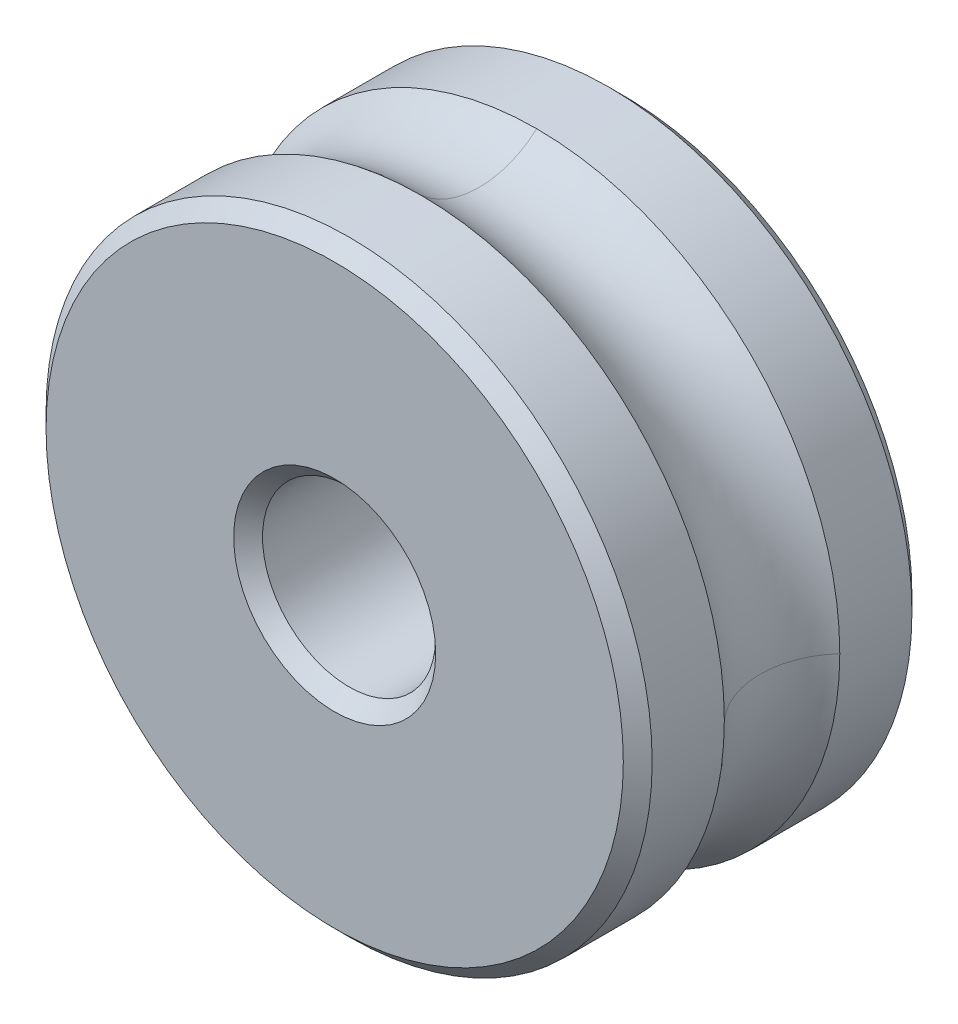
ISO-10303-21;
HEADER;
FILE_DESCRIPTION(('STEP AP214'),'2;1');
FILE_NAME('part.step','',(''),(''),'','','');
FILE_SCHEMA(('AUTOMOTIVE_DESIGN { 1 0 10303 214 1 1 1 1 }'));
ENDSEC;
DATA;
#1=APPLICATION_CONTEXT('core data for automotive mechanical design processes');
#2=APPLICATION_PROTOCOL_DEFINITION('international standard','automotive_design',2000,#1);
#3=PRODUCT_CONTEXT('',#1,'mechanical');
#4=PRODUCT('Part','Part','',(#3));
#5=PRODUCT_RELATED_PRODUCT_CATEGORY('part','',(#4));
#6=PRODUCT_DEFINITION_FORMATION('','',#4);
#7=PRODUCT_DEFINITION_CONTEXT('part definition',#1,'design');
#8=PRODUCT_DEFINITION('design','',#6,#7);
#9=PRODUCT_DEFINITION_SHAPE('','',#8);
#10=(LENGTH_UNIT() NAMED_UNIT(*) SI_UNIT(.MILLI.,.METRE.));
#11=(NAMED_UNIT(*) PLANE_ANGLE_UNIT() SI_UNIT($,.RADIAN.));
#12=(NAMED_UNIT(*) SI_UNIT($,.STERADIAN.) SOLID_ANGLE_UNIT());
#13=UNCERTAINTY_MEASURE_WITH_UNIT(LENGTH_MEASURE(1.E-05),#10,'distance_accuracy_value','');
#14=(GEOMETRIC_REPRESENTATION_CONTEXT(3) GLOBAL_UNCERTAINTY_ASSIGNED_CONTEXT((#13)) GLOBAL_UNIT_ASSIGNED_CONTEXT((#10,
#11,#12)) REPRESENTATION_CONTEXT('',''));
#15=CARTESIAN_POINT('',(0.,0.,0.));
#16=DIRECTION('',(0.,0.,1.));
#17=DIRECTION('',(1.,0.,0.));
#18=AXIS2_PLACEMENT_3D('',#15,#16,#17);
#19=CARTESIAN_POINT('',(0.,0.,10.));
#20=DIRECTION('',(0.,0.,-1.));
#21=DIRECTION('',(-1.,0.,0.));
#22=AXIS2_PLACEMENT_3D('',#19,#20,#21);
#23=CYLINDRICAL_SURFACE('',#22,21.);
#24=CARTESIAN_POINT('',(0.,0.,-4.));
#25=DIRECTION('',(0.,0.,1.));
#26=DIRECTION('',(1.,0.,0.));
#27=AXIS2_PLACEMENT_3D('',#24,#25,#26);
#28=CIRCLE('',#27,21.);
#29=CARTESIAN_POINT('',(0.,21.,-4.));
#30=VERTEX_POINT('',#29);
#31=CARTESIAN_POINT('',(21.,0.,-4.));
#32=VERTEX_POINT('',#31);
#33=EDGE_CURVE('E55',#30,#32,#28,.F.);
#34=ORIENTED_EDGE('',*,*,#33,.T.);
#35=CARTESIAN_POINT('',(0.,0.,-4.));
#36=DIRECTION('',(0.,0.,1.));
#37=DIRECTION('',(1.,0.,0.));
#38=AXIS2_PLACEMENT_3D('',#35,#36,#37);
#39=CIRCLE('',#38,21.);
#40=EDGE_CURVE('E11',#32,#30,#39,.F.);
#41=ORIENTED_EDGE('',*,*,#40,.T.);
#42=EDGE_LOOP('',(#34,#41));
#43=FACE_BOUND('',#42,.T.);
#44=CARTESIAN_POINT('',(0.,0.,-9.));
#45=DIRECTION('',(0.,0.,1.));
#46=DIRECTION('',(1.,0.,0.));
#47=AXIS2_PLACEMENT_3D('',#44,#45,#46);
#48=CIRCLE('',#47,21.);
#49=CARTESIAN_POINT('',(21.,0.,-9.));
#50=VERTEX_POINT('',#49);
#51=EDGE_CURVE('E79',#50,#50,#48,.T.);
#52=ORIENTED_EDGE('',*,*,#51,.T.);
#53=EDGE_LOOP('',(#52));
#54=FACE_BOUND('',#53,.T.);
#55=ADVANCED_FACE('F45',(#43,#54),#23,.T.);
#56=CARTESIAN_POINT('',(0.,0.,10.));
#57=DIRECTION('',(0.,0.,-1.));
#58=DIRECTION('',(-1.,0.,0.));
#59=AXIS2_PLACEMENT_3D('',#56,#57,#58);
#60=CYLINDRICAL_SURFACE('',#59,6.);
#61=CARTESIAN_POINT('',(0.,0.,-8.99999999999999));
#62=DIRECTION('',(0.,0.,1.));
#63=DIRECTION('',(1.,0.,0.));
#64=AXIS2_PLACEMENT_3D('',#61,#62,#63);
#65=CIRCLE('',#64,6.);
#66=CARTESIAN_POINT('',(6.,0.,-8.99999999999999));
#67=VERTEX_POINT('',#66);
#68=EDGE_CURVE('E108',#67,#67,#65,.F.);
#69=ORIENTED_EDGE('',*,*,#68,.T.);
#70=EDGE_LOOP('',(#69));
#71=FACE_BOUND('',#70,.T.);
#72=CARTESIAN_POINT('',(0.,0.,8.99999999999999));
#73=DIRECTION('',(0.,0.,1.));
#74=DIRECTION('',(1.,0.,0.));
#75=AXIS2_PLACEMENT_3D('',#72,#73,#74);
#76=CIRCLE('',#75,6.);
#77=CARTESIAN_POINT('',(6.,0.,8.99999999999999));
#78=VERTEX_POINT('',#77);
#79=EDGE_CURVE('E112',#78,#78,#76,.T.);
#80=ORIENTED_EDGE('',*,*,#79,.T.);
#81=EDGE_LOOP('',(#80));
#82=FACE_BOUND('',#81,.T.);
#83=ADVANCED_FACE('F127',(#71,#82),#60,.F.);
#84=CARTESIAN_POINT('',(0.,0.,4.));
#85=DIRECTION('',(0.,0.,-1.));
#86=DIRECTION('',(-1.,0.,0.));
#87=AXIS2_PLACEMENT_3D('',#84,#85,#86);
#88=CIRCLE('',#87,21.);
#89=CARTESIAN_POINT('',(21.,0.,4.));
#90=VERTEX_POINT('',#89);
#91=CARTESIAN_POINT('',(0.,21.,4.));
#92=VERTEX_POINT('',#91);
#93=EDGE_CURVE('E73',#90,#92,#88,.F.);
#94=ORIENTED_EDGE('',*,*,#93,.T.);
#95=CARTESIAN_POINT('',(0.,0.,4.));
#96=DIRECTION('',(0.,0.,-1.));
#97=DIRECTION('',(-1.,0.,0.));
#98=AXIS2_PLACEMENT_3D('',#95,#96,#97);
#99=CIRCLE('',#98,21.);
#100=EDGE_CURVE('E78',#92,#90,#99,.F.);
#101=ORIENTED_EDGE('',*,*,#100,.T.);
#102=EDGE_LOOP('',(#94,#101));
#103=FACE_BOUND('',#102,.T.);
#104=CARTESIAN_POINT('',(0.,0.,9.));
#105=DIRECTION('',(0.,0.,1.));
#106=DIRECTION('',(1.,0.,0.));
#107=AXIS2_PLACEMENT_3D('',#104,#105,#106);
#108=CIRCLE('',#107,21.);
#109=CARTESIAN_POINT('',(21.,0.,9.));
#110=VERTEX_POINT('',#109);
#111=EDGE_CURVE('E96',#110,#110,#108,.F.);
#112=ORIENTED_EDGE('',*,*,#111,.T.);
#113=EDGE_LOOP('',(#112));
#114=FACE_BOUND('',#113,.T.);
#115=ADVANCED_FACE('F87',(#103,#114),#23,.T.);
#116=CARTESIAN_POINT('',(0.,0.,10.));
#117=DIRECTION('',(0.,0.,1.));
#118=DIRECTION('',(1.,0.,0.));
#119=AXIS2_PLACEMENT_3D('',#116,#117,#118);
#120=PLANE('',#119);
#121=CARTESIAN_POINT('',(0.,0.,10.));
#122=DIRECTION('',(0.,0.,1.));
#123=DIRECTION('',(1.,0.,0.));
#124=AXIS2_PLACEMENT_3D('',#121,#122,#123);
#125=CIRCLE('',#124,7.00000000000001);
#126=CARTESIAN_POINT('',(7.00000000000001,0.,10.));
#127=VERTEX_POINT('',#126);
#128=EDGE_CURVE('E100',#127,#127,#125,.F.);
#129=ORIENTED_EDGE('',*,*,#128,.T.);
#130=EDGE_LOOP('',(#129));
#131=FACE_BOUND('',#130,.T.);
#132=CARTESIAN_POINT('',(0.,0.,10.));
#133=DIRECTION('',(0.,0.,1.));
#134=DIRECTION('',(1.,0.,0.));
#135=AXIS2_PLACEMENT_3D('',#132,#133,#134);
#136=CIRCLE('',#135,20.);
#137=CARTESIAN_POINT('',(20.,0.,10.));
#138=VERTEX_POINT('',#137);
#139=EDGE_CURVE('E104',#138,#138,#136,.T.);
#140=ORIENTED_EDGE('',*,*,#139,.T.);
#141=EDGE_LOOP('',(#140));
#142=FACE_BOUND('',#141,.T.);
#143=ADVANCED_FACE('F162',(#131,#142),#120,.T.);
#144=CARTESIAN_POINT('',(0.,0.,-10.));
#145=DIRECTION('',(0.,0.,1.));
#146=DIRECTION('',(1.,0.,0.));
#147=AXIS2_PLACEMENT_3D('',#144,#145,#146);
#148=PLANE('',#147);
#149=CARTESIAN_POINT('',(0.,0.,-10.));
#150=DIRECTION('',(0.,0.,1.));
#151=DIRECTION('',(1.,0.,0.));
#152=AXIS2_PLACEMENT_3D('',#149,#150,#151);
#153=CIRCLE('',#152,7.00000000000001);
#154=CARTESIAN_POINT('',(7.00000000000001,0.,-10.));
#155=VERTEX_POINT('',#154);
#156=EDGE_CURVE('E116',#155,#155,#153,.T.);
#157=ORIENTED_EDGE('',*,*,#156,.T.);
#158=EDGE_LOOP('',(#157));
#159=FACE_BOUND('',#158,.T.);
#160=CARTESIAN_POINT('',(0.,0.,-10.));
#161=DIRECTION('',(0.,0.,1.));
#162=DIRECTION('',(1.,0.,0.));
#163=AXIS2_PLACEMENT_3D('',#160,#161,#162);
#164=CIRCLE('',#163,20.);
#165=CARTESIAN_POINT('',(20.,0.,-10.));
#166=VERTEX_POINT('',#165);
#167=EDGE_CURVE('E85',#166,#166,#164,.F.);
#168=ORIENTED_EDGE('',*,*,#167,.T.);
#169=EDGE_LOOP('',(#168));
#170=FACE_BOUND('',#169,.T.);
#171=ADVANCED_FACE('F156',(#159,#170),#148,.F.);
#172=CARTESIAN_POINT('',(0.,0.,-10.));
#173=DIRECTION('',(0.,0.,-1.));
#174=DIRECTION('',(-1.,0.,0.));
#175=AXIS2_PLACEMENT_3D('',#172,#173,#174);
#176=CONICAL_SURFACE('',#175,7.00000000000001,0.785398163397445);
#177=ORIENTED_EDGE('',*,*,#68,.F.);
#178=EDGE_LOOP('',(#177));
#179=FACE_BOUND('',#178,.T.);
#180=ORIENTED_EDGE('',*,*,#156,.F.);
#181=EDGE_LOOP('',(#180));
#182=FACE_BOUND('',#181,.T.);
#183=ADVANCED_FACE('F140',(#179,#182),#176,.F.);
#184=CARTESIAN_POINT('',(0.,0.,8.99999999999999));
#185=DIRECTION('',(0.,0.,1.));
#186=DIRECTION('',(1.,0.,0.));
#187=AXIS2_PLACEMENT_3D('',#184,#185,#186);
#188=CONICAL_SURFACE('',#187,6.,0.785398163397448);
#189=ORIENTED_EDGE('',*,*,#128,.F.);
#190=EDGE_LOOP('',(#189));
#191=FACE_BOUND('',#190,.T.);
#192=ORIENTED_EDGE('',*,*,#79,.F.);
#193=EDGE_LOOP('',(#192));
#194=FACE_BOUND('',#193,.T.);
#195=ADVANCED_FACE('F133',(#191,#194),#188,.F.);
#196=CARTESIAN_POINT('',(0.,0.,-9.));
#197=DIRECTION('',(0.,0.,1.));
#198=DIRECTION('',(1.,0.,0.));
#199=AXIS2_PLACEMENT_3D('',#196,#197,#198);
#200=CONICAL_SURFACE('',#199,21.,0.78539816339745);
#201=ORIENTED_EDGE('',*,*,#167,.F.);
#202=EDGE_LOOP('',(#201));
#203=FACE_BOUND('',#202,.T.);
#204=ORIENTED_EDGE('',*,*,#51,.F.);
#205=EDGE_LOOP('',(#204));
#206=FACE_BOUND('',#205,.T.);
#207=ADVANCED_FACE('F131',(#203,#206),#200,.T.);
#208=CARTESIAN_POINT('',(0.,0.,10.));
#209=DIRECTION('',(0.,0.,-1.));
#210=DIRECTION('',(-1.,0.,0.));
#211=AXIS2_PLACEMENT_3D('',#208,#209,#210);
#212=CONICAL_SURFACE('',#211,20.,0.785398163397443);
#213=ORIENTED_EDGE('',*,*,#111,.F.);
#214=EDGE_LOOP('',(#213));
#215=FACE_BOUND('',#214,.T.);
#216=ORIENTED_EDGE('',*,*,#139,.F.);
#217=EDGE_LOOP('',(#216));
#218=FACE_BOUND('',#217,.T.);
#219=ADVANCED_FACE('F48',(#215,#218),#212,.T.);
#220=CARTESIAN_POINT('',(0.,0.,0.));
#221=DIRECTION('',(0.,0.,-1.));
#222=DIRECTION('',(-1.,0.,0.));
#223=AXIS2_PLACEMENT_3D('',#220,#221,#222);
#224=TOROIDAL_SURFACE('',#223,25.4721359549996,6.);
#225=CARTESIAN_POINT('',(25.4721359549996,0.,0.));
#226=DIRECTION('',(0.,-1.,0.));
#227=DIRECTION('',(0.,0.,-1.));
#228=AXIS2_PLACEMENT_3D('',#225,#226,#227);
#229=CIRCLE('',#228,6.);
#230=EDGE_CURVE('E62',#90,#32,#229,.T.);
#231=ORIENTED_EDGE('',*,*,#230,.F.);
#232=ORIENTED_EDGE('',*,*,#100,.F.);
#233=CARTESIAN_POINT('',(0.,25.4721359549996,0.));
#234=DIRECTION('',(1.,0.,0.));
#235=DIRECTION('',(0.,0.,-1.));
#236=AXIS2_PLACEMENT_3D('',#233,#234,#235);
#237=CIRCLE('',#236,6.);
#238=EDGE_CURVE('E67',#92,#30,#237,.T.);
#239=ORIENTED_EDGE('',*,*,#238,.T.);
#240=ORIENTED_EDGE('',*,*,#40,.F.);
#241=EDGE_LOOP('',(#231,#232,#239,#240));
#242=FACE_BOUND('',#241,.T.);
#243=ADVANCED_FACE('F82',(#242),#224,.F.);
#244=CARTESIAN_POINT('',(0.,0.,0.));
#245=DIRECTION('',(0.,0.,-1.));
#246=DIRECTION('',(-1.,0.,0.));
#247=AXIS2_PLACEMENT_3D('',#244,#245,#246);
#248=TOROIDAL_SURFACE('',#247,25.4721359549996,6.);
#249=ORIENTED_EDGE('',*,*,#238,.F.);
#250=ORIENTED_EDGE('',*,*,#93,.F.);
#251=ORIENTED_EDGE('',*,*,#230,.T.);
#252=ORIENTED_EDGE('',*,*,#33,.F.);
#253=EDGE_LOOP('',(#249,#250,#251,#252));
#254=FACE_BOUND('',#253,.T.);
#255=ADVANCED_FACE('F74',(#254),#248,.F.);
#256=CLOSED_SHELL('',(#55,#83,#115,#143,#171,#183,#195,#207,#219,#243,#255));
#257=MANIFOLD_SOLID_BREP('B2',#256);
#258=ADVANCED_BREP_SHAPE_REPRESENTATION('',(#18,#257),#14);
#259=SHAPE_DEFINITION_REPRESENTATION(#9,#258);
ENDSEC;
END-ISO-10303-21;
